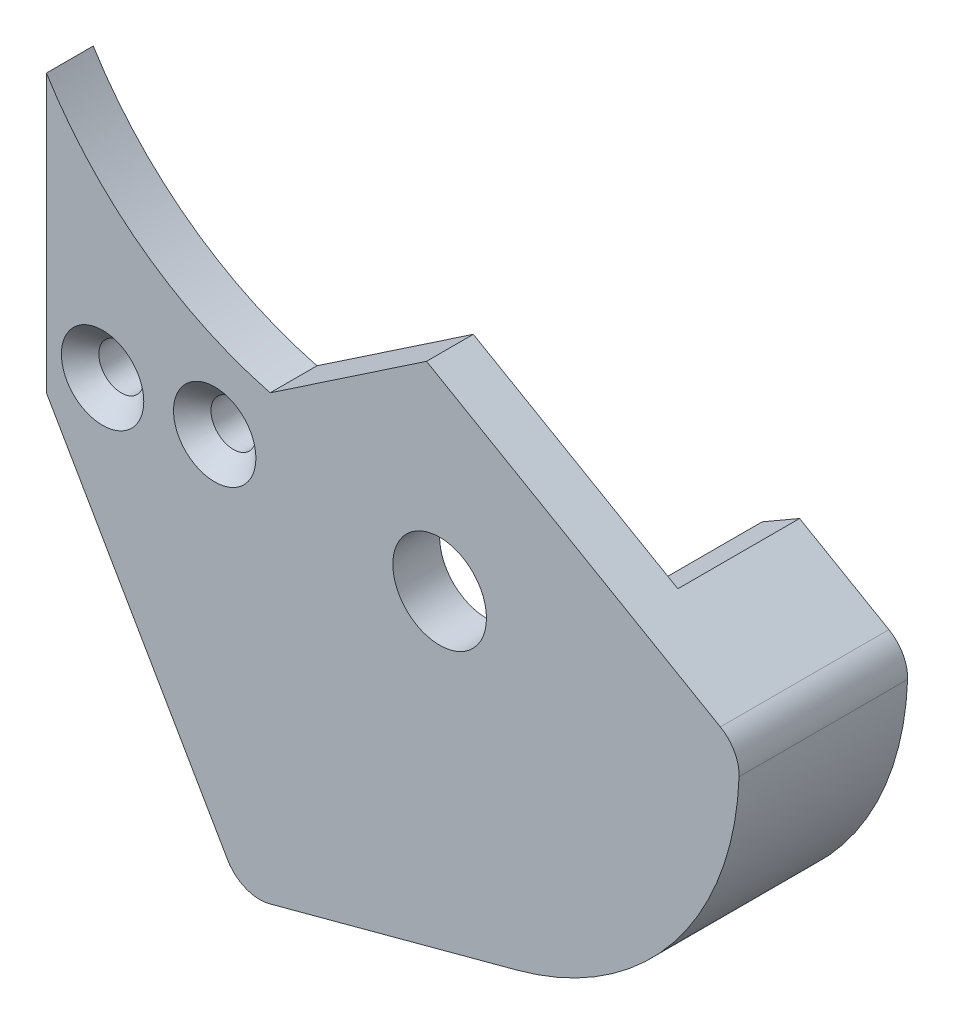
from build123d import *

# Parameters (mm, degrees)
BOSS_EXTRU_1_DEPTH                             = 6.5
ESQUISSE2_R                                    = 2.5
BOSS_EXTRU_2_DEPTH                             = 2.5
ESQUISSE3_R                                    = 3
ENL_V_MAT_EXTRU_1_DEPTH                        = 2.5
ENL_V_MAT_EXTRU_2_DEPTH                        = 6.5
FRAISAGE_POUR_VIS_T_TE_FRAIS_E_M21_D           = 2.4
FRAISAGE_POUR_VIS_T_TE_FRAIS_E_M21_CSINK_D     = 4.4
FRAISAGE_POUR_VIS_T_TE_FRAIS_E_M21_CSINK_ANGLE = 90
R_P_TITION_LIN_AIRE1_COUNT                     = 2
R_P_TITION_LIN_AIRE1_PITCH                     = 6


with BuildPart() as part:
    # Esquisse1 → Boss.-Extru.1 (new body)
    with BuildSketch(Plane.XY):
        with BuildLine():
            Line((18, 42.176914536), (27.666806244, 25.433514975))
            ThreePointArc((27.666806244, 25.433514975), (28.633490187, 24.58575591), (29.916495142, 24.501663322))
            Line((29.916495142, 24.501663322), (43.141104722, 28.045186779))
            ThreePointArc((43.141104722, 28.045186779), (51.513304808, 33.529182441), (54.989286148, 42.91456983))
            ThreePointArc((54.989286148, 42.91456983), (54.740683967, 43.95588854), (53.990625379, 44.719799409))
            Line((53.990625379, 44.719799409), (49.220478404, 47.473845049))
            Line((49.220478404, 47.473845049), (47.220478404, 46.319144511))
            Line((47.220478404, 46.319144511), (51.891539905, 43.622305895))
            ThreePointArc((51.891539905, 43.622305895), (52.686897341, 42.771556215), (52.873463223, 41.621964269))
            ThreePointArc((52.873463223, 41.621964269), (49.508887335, 34.249957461), (42.623466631, 29.977038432))
            Line((42.623466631, 29.977038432), (30.881218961, 26.830712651))
            ThreePointArc((30.881218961, 26.830712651), (29.598214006, 26.914805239), (28.631530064, 27.762564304))
            Line((28.631530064, 27.762564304), (19.732050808, 43.176914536))
            Line((19.732050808, 43.176914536), (18, 42.176914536))
        make_face()
    extrude(amount=BOSS_EXTRU_1_DEPTH)

    # Esquisse2 → Boss.-Extru.2 (add)
    with BuildSketch(Plane.XY.offset(6.5)):
        with BuildLine():
            Line((18, 42.176914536), (27.666806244, 25.433514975))
            ThreePointArc((27.666806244, 25.433514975), (28.633490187, 24.58575591), (29.916495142, 24.501663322))
            Line((29.916495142, 24.501663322), (43.141104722, 28.045186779))
            ThreePointArc((43.141104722, 28.045186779), (51.513304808, 33.529182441), (54.989286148, 42.91456983))
            ThreePointArc((54.989286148, 42.91456983), (54.740683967, 43.95588854), (53.990625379, 44.719799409))
            Line((53.990625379, 44.719799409), (38.297569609, 53.780189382))
            Line((38.297569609, 53.780189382), (29.948140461, 48.148547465))
            ThreePointArc((29.948140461, 48.148547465), (23.125628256, 51.406544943), (18, 56.964346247))
            Line((18, 56.964346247), (18, 42.176914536))
        make_face()
        with Locations((39, 43.5)):
            Circle(ESQUISSE2_R, mode=Mode.SUBTRACT)
    extrude(amount=BOSS_EXTRU_2_DEPTH)

    # Esquisse3 → Enl_v. mat.-Extru.1 (cut)
    with BuildSketch(Plane(origin=(31.763139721, 18.338457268, 0), x_dir=(0, 0, 1), z_dir=(-0.8660254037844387, -0.49999999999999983, 0))):
        with Locations((2.5, 17.526279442)):
            Circle(ESQUISSE3_R)
    extrude(amount=-ENL_V_MAT_EXTRU_1_DEPTH, mode=Mode.SUBTRACT)

    # Esquisse4 → Enl_v. mat.-Extru.2 (cut)
    with BuildSketch(Plane(origin=(0, 0, 0), x_dir=(-1, 0, 0), z_dir=(0, 0, -1))):
        Polygon((-18, 42.176914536), (-33.377022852, 43.145729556), (-15.812006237, 47.764577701), align=None)
    extrude(amount=-ENL_V_MAT_EXTRU_2_DEPTH, mode=Mode.SUBTRACT)

    # Fraisage pour vis _ t_te frais_e M21 (through all)
    with Locations(Plane.XY.offset(9)):
        with Locations((21, 44.369892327)):
            fraisage_pour_vis_t_te_frais_e_m21 = CounterSinkHole(FRAISAGE_POUR_VIS_T_TE_FRAIS_E_M21_D / 2, FRAISAGE_POUR_VIS_T_TE_FRAIS_E_M21_CSINK_D / 2, counter_sink_angle=FRAISAGE_POUR_VIS_T_TE_FRAIS_E_M21_CSINK_ANGLE)

    # R_p_tition lin_aire1: Fraisage pour vis _ t_te frais_e M21 ×2
    with Locations(*[Vector(0.9980211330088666, 0.06287939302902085, 0) * (i * R_P_TITION_LIN_AIRE1_PITCH) for i in range(1, R_P_TITION_LIN_AIRE1_COUNT)]):
        add(fraisage_pour_vis_t_te_frais_e_m21, mode=Mode.SUBTRACT)


solid = part.part
